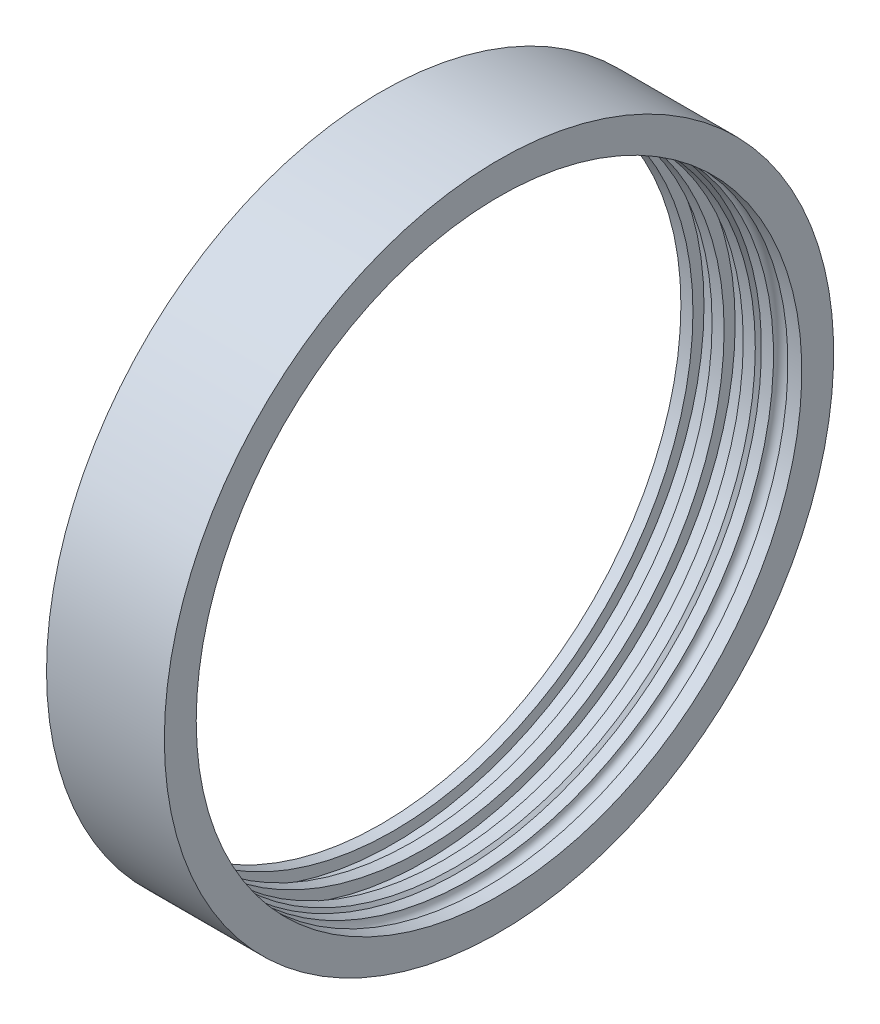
ISO-10303-21;
HEADER;
FILE_DESCRIPTION(('STEP AP214'),'2;1');
FILE_NAME('part.step','',(''),(''),'','','');
FILE_SCHEMA(('AUTOMOTIVE_DESIGN { 1 0 10303 214 1 1 1 1 }'));
ENDSEC;
DATA;
#1=APPLICATION_CONTEXT('core data for automotive mechanical design processes');
#2=APPLICATION_PROTOCOL_DEFINITION('international standard','automotive_design',2000,#1);
#3=PRODUCT_CONTEXT('',#1,'mechanical');
#4=PRODUCT('Part','Part','',(#3));
#5=PRODUCT_RELATED_PRODUCT_CATEGORY('part','',(#4));
#6=PRODUCT_DEFINITION_FORMATION('','',#4);
#7=PRODUCT_DEFINITION_CONTEXT('part definition',#1,'design');
#8=PRODUCT_DEFINITION('design','',#6,#7);
#9=PRODUCT_DEFINITION_SHAPE('','',#8);
#10=(LENGTH_UNIT() NAMED_UNIT(*) SI_UNIT(.MILLI.,.METRE.));
#11=(NAMED_UNIT(*) PLANE_ANGLE_UNIT() SI_UNIT($,.RADIAN.));
#12=(NAMED_UNIT(*) SI_UNIT($,.STERADIAN.) SOLID_ANGLE_UNIT());
#13=UNCERTAINTY_MEASURE_WITH_UNIT(LENGTH_MEASURE(1.E-05),#10,'distance_accuracy_value','');
#14=(GEOMETRIC_REPRESENTATION_CONTEXT(3) GLOBAL_UNCERTAINTY_ASSIGNED_CONTEXT((#13)) GLOBAL_UNIT_ASSIGNED_CONTEXT((#10,
#11,#12)) REPRESENTATION_CONTEXT('',''));
#15=CARTESIAN_POINT('',(0.,0.,0.));
#16=DIRECTION('',(0.,0.,1.));
#17=DIRECTION('',(1.,0.,0.));
#18=AXIS2_PLACEMENT_3D('',#15,#16,#17);
#19=CARTESIAN_POINT('',(24.0411000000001,0.,0.));
#20=DIRECTION('',(-1.,0.,0.));
#21=DIRECTION('',(0.,0.,1.));
#22=AXIS2_PLACEMENT_3D('',#19,#20,#21);
#23=TOROIDAL_SURFACE('',#22,75.2602,1.7907);
#24=CARTESIAN_POINT('',(22.2504000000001,0.,0.));
#25=DIRECTION('',(-1.,0.,0.));
#26=DIRECTION('',(0.,0.,1.));
#27=AXIS2_PLACEMENT_3D('',#24,#25,#26);
#28=CIRCLE('',#27,75.2602);
#29=CARTESIAN_POINT('',(22.2504000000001,0.,75.2602));
#30=VERTEX_POINT('',#29);
#31=EDGE_CURVE('E84',#30,#30,#28,.T.);
#32=ORIENTED_EDGE('',*,*,#31,.T.);
#33=EDGE_LOOP('',(#32));
#34=FACE_BOUND('',#33,.T.);
#35=CARTESIAN_POINT('',(25.8318000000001,0.,0.));
#36=DIRECTION('',(-1.,0.,0.));
#37=DIRECTION('',(0.,0.,1.));
#38=AXIS2_PLACEMENT_3D('',#35,#36,#37);
#39=CIRCLE('',#38,75.2602);
#40=CARTESIAN_POINT('',(25.8318000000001,0.,75.2602));
#41=VERTEX_POINT('',#40);
#42=EDGE_CURVE('E10',#41,#41,#39,.T.);
#43=ORIENTED_EDGE('',*,*,#42,.F.);
#44=EDGE_LOOP('',(#43));
#45=FACE_BOUND('',#44,.T.);
#46=ADVANCED_FACE('F32',(#34,#45),#23,.F.);
#47=CARTESIAN_POINT('',(0.,0.,0.));
#48=DIRECTION('',(-1.,0.,0.));
#49=DIRECTION('',(0.,0.,1.));
#50=AXIS2_PLACEMENT_3D('',#47,#48,#49);
#51=CYLINDRICAL_SURFACE('',#50,75.2602);
#52=ORIENTED_EDGE('',*,*,#42,.T.);
#53=EDGE_LOOP('',(#52));
#54=FACE_BOUND('',#53,.T.);
#55=CARTESIAN_POINT('',(29.2862000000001,0.,0.));
#56=DIRECTION('',(-1.,0.,0.));
#57=DIRECTION('',(0.,0.,1.));
#58=AXIS2_PLACEMENT_3D('',#55,#56,#57);
#59=CIRCLE('',#58,75.2602);
#60=CARTESIAN_POINT('',(29.2862000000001,0.,75.2602));
#61=VERTEX_POINT('',#60);
#62=EDGE_CURVE('E38',#61,#61,#59,.T.);
#63=ORIENTED_EDGE('',*,*,#62,.F.);
#64=EDGE_LOOP('',(#63));
#65=FACE_BOUND('',#64,.T.);
#66=ADVANCED_FACE('F108',(#54,#65),#51,.F.);
#67=CARTESIAN_POINT('',(29.2862,0.,-2.82070485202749E-13));
#68=DIRECTION('',(1.,0.,0.));
#69=DIRECTION('',(0.,0.,-1.));
#70=AXIS2_PLACEMENT_3D('',#67,#68,#69);
#71=PLANE('',#70);
#72=ORIENTED_EDGE('',*,*,#62,.T.);
#73=EDGE_LOOP('',(#72));
#74=FACE_BOUND('',#73,.T.);
#75=CARTESIAN_POINT('',(29.2862,0.,0.));
#76=DIRECTION('',(-1.,0.,0.));
#77=DIRECTION('',(0.,0.,1.));
#78=AXIS2_PLACEMENT_3D('',#75,#76,#77);
#79=CIRCLE('',#78,83.185);
#80=CARTESIAN_POINT('',(29.2862,0.,83.185));
#81=VERTEX_POINT('',#80);
#82=EDGE_CURVE('E42',#81,#81,#79,.T.);
#83=ORIENTED_EDGE('',*,*,#82,.F.);
#84=EDGE_LOOP('',(#83));
#85=FACE_BOUND('',#84,.T.);
#86=ADVANCED_FACE('F112',(#74,#85),#71,.T.);
#87=CARTESIAN_POINT('',(0.,0.,0.));
#88=DIRECTION('',(-1.,0.,0.));
#89=DIRECTION('',(0.,0.,1.));
#90=AXIS2_PLACEMENT_3D('',#87,#88,#89);
#91=CYLINDRICAL_SURFACE('',#90,83.185);
#92=ORIENTED_EDGE('',*,*,#82,.T.);
#93=EDGE_LOOP('',(#92));
#94=FACE_BOUND('',#93,.T.);
#95=CARTESIAN_POINT('',(0.,0.,0.));
#96=DIRECTION('',(-1.,0.,0.));
#97=DIRECTION('',(0.,0.,1.));
#98=AXIS2_PLACEMENT_3D('',#95,#96,#97);
#99=CIRCLE('',#98,83.185);
#100=CARTESIAN_POINT('',(0.,0.,83.185));
#101=VERTEX_POINT('',#100);
#102=EDGE_CURVE('E46',#101,#101,#99,.T.);
#103=ORIENTED_EDGE('',*,*,#102,.F.);
#104=EDGE_LOOP('',(#103));
#105=FACE_BOUND('',#104,.T.);
#106=ADVANCED_FACE('F116',(#94,#105),#91,.T.);
#107=CARTESIAN_POINT('',(0.,0.,0.));
#108=DIRECTION('',(-1.,0.,0.));
#109=DIRECTION('',(0.,0.,1.));
#110=AXIS2_PLACEMENT_3D('',#107,#108,#109);
#111=PLANE('',#110);
#112=ORIENTED_EDGE('',*,*,#102,.T.);
#113=EDGE_LOOP('',(#112));
#114=FACE_BOUND('',#113,.T.);
#115=CARTESIAN_POINT('',(0.,0.,0.));
#116=DIRECTION('',(-1.,0.,0.));
#117=DIRECTION('',(0.,0.,1.));
#118=AXIS2_PLACEMENT_3D('',#115,#116,#117);
#119=CIRCLE('',#118,74.4982);
#120=CARTESIAN_POINT('',(0.,0.,74.4982));
#121=VERTEX_POINT('',#120);
#122=EDGE_CURVE('E51',#121,#121,#119,.T.);
#123=ORIENTED_EDGE('',*,*,#122,.F.);
#124=EDGE_LOOP('',(#123));
#125=FACE_BOUND('',#124,.T.);
#126=ADVANCED_FACE('F122',(#114,#125),#111,.T.);
#127=CARTESIAN_POINT('',(0.,0.,0.));
#128=DIRECTION('',(-1.,0.,0.));
#129=DIRECTION('',(0.,0.,1.));
#130=AXIS2_PLACEMENT_3D('',#127,#128,#129);
#131=CYLINDRICAL_SURFACE('',#130,74.4982);
#132=ORIENTED_EDGE('',*,*,#122,.T.);
#133=EDGE_LOOP('',(#132));
#134=FACE_BOUND('',#133,.T.);
#135=CARTESIAN_POINT('',(2.99720000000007,0.,0.));
#136=DIRECTION('',(-1.,0.,0.));
#137=DIRECTION('',(0.,0.,1.));
#138=AXIS2_PLACEMENT_3D('',#135,#136,#137);
#139=CIRCLE('',#138,74.4982);
#140=CARTESIAN_POINT('',(2.99720000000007,0.,74.4982));
#141=VERTEX_POINT('',#140);
#142=EDGE_CURVE('E54',#141,#141,#139,.T.);
#143=ORIENTED_EDGE('',*,*,#142,.F.);
#144=EDGE_LOOP('',(#143));
#145=FACE_BOUND('',#144,.T.);
#146=ADVANCED_FACE('F126',(#134,#145),#131,.F.);
#147=CARTESIAN_POINT('',(2.99720000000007,0.,0.));
#148=DIRECTION('',(1.,0.,0.));
#149=DIRECTION('',(0.,0.,-1.));
#150=AXIS2_PLACEMENT_3D('',#147,#148,#149);
#151=PLANE('',#150);
#152=ORIENTED_EDGE('',*,*,#142,.T.);
#153=EDGE_LOOP('',(#152));
#154=FACE_BOUND('',#153,.T.);
#155=CARTESIAN_POINT('',(2.99720000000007,0.,0.));
#156=DIRECTION('',(-1.,0.,0.));
#157=DIRECTION('',(0.,0.,1.));
#158=AXIS2_PLACEMENT_3D('',#155,#156,#157);
#159=CIRCLE('',#158,77.2414);
#160=CARTESIAN_POINT('',(2.99720000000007,0.,77.2414));
#161=VERTEX_POINT('',#160);
#162=EDGE_CURVE('E57',#161,#161,#159,.T.);
#163=ORIENTED_EDGE('',*,*,#162,.F.);
#164=EDGE_LOOP('',(#163));
#165=FACE_BOUND('',#164,.T.);
#166=ADVANCED_FACE('F130',(#154,#165),#151,.T.);
#167=CARTESIAN_POINT('',(0.,0.,0.));
#168=DIRECTION('',(-1.,0.,0.));
#169=DIRECTION('',(0.,0.,1.));
#170=AXIS2_PLACEMENT_3D('',#167,#168,#169);
#171=CYLINDRICAL_SURFACE('',#170,77.2414);
#172=ORIENTED_EDGE('',*,*,#162,.T.);
#173=EDGE_LOOP('',(#172));
#174=FACE_BOUND('',#173,.T.);
#175=CARTESIAN_POINT('',(7.74700000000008,0.,0.));
#176=DIRECTION('',(-1.,0.,0.));
#177=DIRECTION('',(0.,0.,1.));
#178=AXIS2_PLACEMENT_3D('',#175,#176,#177);
#179=CIRCLE('',#178,77.2414);
#180=CARTESIAN_POINT('',(7.74700000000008,0.,77.2414));
#181=VERTEX_POINT('',#180);
#182=EDGE_CURVE('E60',#181,#181,#179,.T.);
#183=ORIENTED_EDGE('',*,*,#182,.F.);
#184=EDGE_LOOP('',(#183));
#185=FACE_BOUND('',#184,.T.);
#186=ADVANCED_FACE('F134',(#174,#185),#171,.F.);
#187=CARTESIAN_POINT('',(7.74700000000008,0.,0.));
#188=DIRECTION('',(-1.,0.,0.));
#189=DIRECTION('',(0.,0.,1.));
#190=AXIS2_PLACEMENT_3D('',#187,#188,#189);
#191=PLANE('',#190);
#192=ORIENTED_EDGE('',*,*,#182,.T.);
#193=EDGE_LOOP('',(#192));
#194=FACE_BOUND('',#193,.T.);
#195=CARTESIAN_POINT('',(7.74700000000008,0.,0.));
#196=DIRECTION('',(-1.,0.,0.));
#197=DIRECTION('',(0.,0.,1.));
#198=AXIS2_PLACEMENT_3D('',#195,#196,#197);
#199=CIRCLE('',#198,74.4982);
#200=CARTESIAN_POINT('',(7.74700000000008,0.,74.4982));
#201=VERTEX_POINT('',#200);
#202=EDGE_CURVE('E63',#201,#201,#199,.T.);
#203=ORIENTED_EDGE('',*,*,#202,.F.);
#204=EDGE_LOOP('',(#203));
#205=FACE_BOUND('',#204,.T.);
#206=ADVANCED_FACE('F138',(#194,#205),#191,.T.);
#207=CARTESIAN_POINT('',(0.,0.,0.));
#208=DIRECTION('',(-1.,0.,0.));
#209=DIRECTION('',(0.,0.,1.));
#210=AXIS2_PLACEMENT_3D('',#207,#208,#209);
#211=CYLINDRICAL_SURFACE('',#210,74.4982);
#212=ORIENTED_EDGE('',*,*,#202,.T.);
#213=EDGE_LOOP('',(#212));
#214=FACE_BOUND('',#213,.T.);
#215=CARTESIAN_POINT('',(10.7442000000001,0.,0.));
#216=DIRECTION('',(-1.,0.,0.));
#217=DIRECTION('',(0.,0.,1.));
#218=AXIS2_PLACEMENT_3D('',#215,#216,#217);
#219=CIRCLE('',#218,74.4982);
#220=CARTESIAN_POINT('',(10.7442000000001,0.,74.4982));
#221=VERTEX_POINT('',#220);
#222=EDGE_CURVE('E66',#221,#221,#219,.T.);
#223=ORIENTED_EDGE('',*,*,#222,.F.);
#224=EDGE_LOOP('',(#223));
#225=FACE_BOUND('',#224,.T.);
#226=ADVANCED_FACE('F142',(#214,#225),#211,.F.);
#227=CARTESIAN_POINT('',(10.7442000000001,0.,0.));
#228=DIRECTION('',(1.,0.,0.));
#229=DIRECTION('',(0.,0.,-1.));
#230=AXIS2_PLACEMENT_3D('',#227,#228,#229);
#231=PLANE('',#230);
#232=ORIENTED_EDGE('',*,*,#222,.T.);
#233=EDGE_LOOP('',(#232));
#234=FACE_BOUND('',#233,.T.);
#235=CARTESIAN_POINT('',(10.7442000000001,0.,0.));
#236=DIRECTION('',(-1.,0.,0.));
#237=DIRECTION('',(0.,0.,1.));
#238=AXIS2_PLACEMENT_3D('',#235,#236,#237);
#239=CIRCLE('',#238,77.2414);
#240=CARTESIAN_POINT('',(10.7442000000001,0.,77.2414));
#241=VERTEX_POINT('',#240);
#242=EDGE_CURVE('E69',#241,#241,#239,.T.);
#243=ORIENTED_EDGE('',*,*,#242,.F.);
#244=EDGE_LOOP('',(#243));
#245=FACE_BOUND('',#244,.T.);
#246=ADVANCED_FACE('F146',(#234,#245),#231,.T.);
#247=CARTESIAN_POINT('',(0.,0.,0.));
#248=DIRECTION('',(-1.,0.,0.));
#249=DIRECTION('',(0.,0.,1.));
#250=AXIS2_PLACEMENT_3D('',#247,#248,#249);
#251=CYLINDRICAL_SURFACE('',#250,77.2414);
#252=ORIENTED_EDGE('',*,*,#242,.T.);
#253=EDGE_LOOP('',(#252));
#254=FACE_BOUND('',#253,.T.);
#255=CARTESIAN_POINT('',(15.4940000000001,0.,0.));
#256=DIRECTION('',(-1.,0.,0.));
#257=DIRECTION('',(0.,0.,1.));
#258=AXIS2_PLACEMENT_3D('',#255,#256,#257);
#259=CIRCLE('',#258,77.2414);
#260=CARTESIAN_POINT('',(15.4940000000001,0.,77.2414));
#261=VERTEX_POINT('',#260);
#262=EDGE_CURVE('E72',#261,#261,#259,.T.);
#263=ORIENTED_EDGE('',*,*,#262,.F.);
#264=EDGE_LOOP('',(#263));
#265=FACE_BOUND('',#264,.T.);
#266=ADVANCED_FACE('F150',(#254,#265),#251,.F.);
#267=CARTESIAN_POINT('',(15.4940000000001,0.,0.));
#268=DIRECTION('',(-1.,0.,0.));
#269=DIRECTION('',(0.,0.,1.));
#270=AXIS2_PLACEMENT_3D('',#267,#268,#269);
#271=PLANE('',#270);
#272=ORIENTED_EDGE('',*,*,#262,.T.);
#273=EDGE_LOOP('',(#272));
#274=FACE_BOUND('',#273,.T.);
#275=CARTESIAN_POINT('',(15.4940000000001,0.,0.));
#276=DIRECTION('',(-1.,0.,0.));
#277=DIRECTION('',(0.,0.,1.));
#278=AXIS2_PLACEMENT_3D('',#275,#276,#277);
#279=CIRCLE('',#278,74.4982);
#280=CARTESIAN_POINT('',(15.4940000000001,0.,74.4982));
#281=VERTEX_POINT('',#280);
#282=EDGE_CURVE('E75',#281,#281,#279,.T.);
#283=ORIENTED_EDGE('',*,*,#282,.F.);
#284=EDGE_LOOP('',(#283));
#285=FACE_BOUND('',#284,.T.);
#286=ADVANCED_FACE('F104',(#274,#285),#271,.T.);
#287=CARTESIAN_POINT('',(0.,0.,0.));
#288=DIRECTION('',(-1.,0.,0.));
#289=DIRECTION('',(0.,0.,1.));
#290=AXIS2_PLACEMENT_3D('',#287,#288,#289);
#291=CYLINDRICAL_SURFACE('',#290,74.4982);
#292=ORIENTED_EDGE('',*,*,#282,.T.);
#293=EDGE_LOOP('',(#292));
#294=FACE_BOUND('',#293,.T.);
#295=CARTESIAN_POINT('',(18.4912000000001,0.,0.));
#296=DIRECTION('',(-1.,0.,0.));
#297=DIRECTION('',(0.,0.,1.));
#298=AXIS2_PLACEMENT_3D('',#295,#296,#297);
#299=CIRCLE('',#298,74.4982);
#300=CARTESIAN_POINT('',(18.4912000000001,0.,74.4982));
#301=VERTEX_POINT('',#300);
#302=EDGE_CURVE('E78',#301,#301,#299,.T.);
#303=ORIENTED_EDGE('',*,*,#302,.F.);
#304=EDGE_LOOP('',(#303));
#305=FACE_BOUND('',#304,.T.);
#306=ADVANCED_FACE('F98',(#294,#305),#291,.F.);
#307=CARTESIAN_POINT('',(19.2532000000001,0.,0.));
#308=DIRECTION('',(1.,0.,0.));
#309=DIRECTION('',(0.,0.,-1.));
#310=AXIS2_PLACEMENT_3D('',#307,#308,#309);
#311=CONICAL_SURFACE('',#310,75.2602,0.785398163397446);
#312=ORIENTED_EDGE('',*,*,#302,.T.);
#313=EDGE_LOOP('',(#312));
#314=FACE_BOUND('',#313,.T.);
#315=CARTESIAN_POINT('',(19.2532000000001,0.,0.));
#316=DIRECTION('',(-1.,0.,0.));
#317=DIRECTION('',(0.,0.,1.));
#318=AXIS2_PLACEMENT_3D('',#315,#316,#317);
#319=CIRCLE('',#318,75.2602);
#320=CARTESIAN_POINT('',(19.2532000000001,0.,75.2602));
#321=VERTEX_POINT('',#320);
#322=EDGE_CURVE('E81',#321,#321,#319,.T.);
#323=ORIENTED_EDGE('',*,*,#322,.F.);
#324=EDGE_LOOP('',(#323));
#325=FACE_BOUND('',#324,.T.);
#326=ADVANCED_FACE('F93',(#314,#325),#311,.F.);
#327=CARTESIAN_POINT('',(0.,0.,0.));
#328=DIRECTION('',(-1.,0.,0.));
#329=DIRECTION('',(0.,0.,1.));
#330=AXIS2_PLACEMENT_3D('',#327,#328,#329);
#331=CYLINDRICAL_SURFACE('',#330,75.2602);
#332=ORIENTED_EDGE('',*,*,#31,.F.);
#333=EDGE_LOOP('',(#332));
#334=FACE_BOUND('',#333,.T.);
#335=ORIENTED_EDGE('',*,*,#322,.T.);
#336=EDGE_LOOP('',(#335));
#337=FACE_BOUND('',#336,.T.);
#338=ADVANCED_FACE('F90',(#334,#337),#331,.F.);
#339=CLOSED_SHELL('',(#46,#66,#86,#106,#126,#146,#166,#186,#206,#226,#246,#266,#286,#306,#326,#338));
#340=MANIFOLD_SOLID_BREP('B2',#339);
#341=ADVANCED_BREP_SHAPE_REPRESENTATION('',(#18,#340),#14);
#342=SHAPE_DEFINITION_REPRESENTATION(#9,#341);
ENDSEC;
END-ISO-10303-21;
